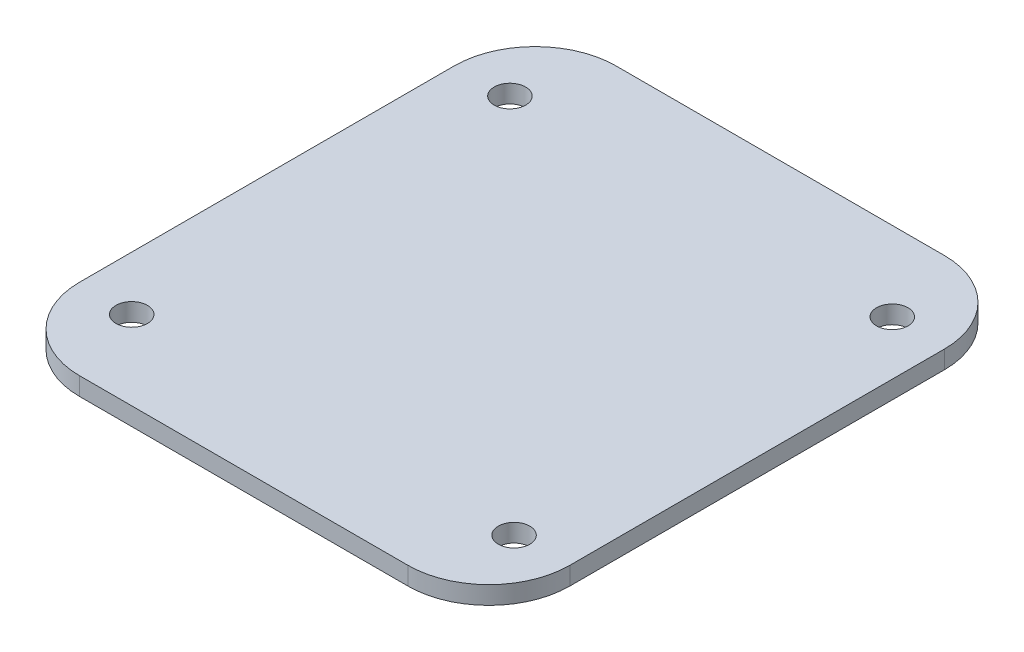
from build123d import *

# Parameters (mm, degrees)
SKETCH4_W           = 806.016009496
SKETCH4_H           = 989.965782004
MAIN_PLATE_DEPTH    = 25.4
FILLET1_R           = 139.7
SKETCH6_W           = 1279.473921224
SKETCH6_H           = 1537.086120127
EDGE_CUT_DEPTH      = 25.4
SKETCH7_W           = 1001.273344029
SKETCH7_H           = 1127.498603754
CUT_EXTRUDE4_DEPTH  = 25.4
SKETCH17_R          = 26.19375
CUT_EXTRUDE12_DEPTH = 621.952724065
SKETCH18_W          = 1235.621327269
SKETCH18_H          = 1247.027062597
CUT_EXTRUDE13_DEPTH = 621.952724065
SKETCH19_R          = 31.75
SKETCH19_R_2        = 22.225
BOSS_EXTRUDE3_DEPTH = 25.4


with BuildPart() as part:
    # Sketch4 → main plate (new body)
    with BuildSketch(Plane(origin=(0, 0, 0), x_dir=(1, 0, 0), z_dir=(0, 1, 0))):
        Rectangle(SKETCH4_W, SKETCH4_H)
    extrude(amount=MAIN_PLATE_DEPTH)

    # Fillet1
    fillet1_edges = [part.edges().sort_by_distance(p)[0] for p in [
        (-403.008004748, 12.7, -494.982891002),
        (403.008004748, 12.7, -494.982891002),
        (403.008004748, 12.7, 494.982891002),
        (-403.008004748, 12.7, 494.982891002),
    ]]
    fillet(fillet1_edges, radius=FILLET1_R)

    # Sketch6 → Edge cut (cut)
    with BuildSketch(Plane(origin=(0, 0, 0), x_dir=(1, 0, 0), z_dir=(0, 1, 0))):
        with Locations((66.592499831, 11.525402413)):
            Rectangle(SKETCH6_W, SKETCH6_H)
        with BuildLine():
            Line((403.008004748, 368.667884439), (403.008004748, -368.667884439))
            ThreePointArc((403.008004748, -368.667884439), (376.969797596, -431.529677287), (314.108004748, -457.567884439))
            Line((314.108004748, -457.567884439), (108.167567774, -457.567884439))
            ThreePointArc((108.167567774, -457.567884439), (83.867169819, -462.401534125), (63.266287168, -476.166603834))
            Line((63.266287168, -476.166603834), (63.048719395, -476.384171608))
            ThreePointArc((63.048719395, -476.384171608), (42.447836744, -490.149241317), (18.147438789, -494.982891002))
            Line((18.147438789, -494.982891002), (-18.147438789, -494.982891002))
            ThreePointArc((-18.147438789, -494.982891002), (-42.447836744, -490.149241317), (-63.048719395, -476.384171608))
            Line((-63.048719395, -476.384171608), (-63.266287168, -476.166603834))
            ThreePointArc((-63.266287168, -476.166603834), (-83.867169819, -462.401534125), (-108.167567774, -457.567884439))
            Line((-108.167567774, -457.567884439), (-314.108004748, -457.567884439))
            ThreePointArc((-314.108004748, -457.567884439), (-376.969797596, -431.529677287), (-403.008004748, -368.667884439))
            Line((-403.008004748, -368.667884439), (-403.008004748, 368.667884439))
            ThreePointArc((-403.008004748, 368.667884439), (-376.969797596, 431.529677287), (-314.108004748, 457.567884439))
            Line((-314.108004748, 457.567884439), (-108.167567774, 457.567884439))
            ThreePointArc((-108.167567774, 457.567884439), (-83.867169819, 462.401534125), (-63.266287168, 476.166603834))
            Line((-63.266287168, 476.166603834), (-63.048719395, 476.384171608))
            ThreePointArc((-63.048719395, 476.384171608), (-42.447836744, 490.149241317), (-18.147438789, 494.982891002))
            Line((-18.147438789, 494.982891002), (18.147438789, 494.982891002))
            ThreePointArc((18.147438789, 494.982891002), (42.447836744, 490.149241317), (63.048719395, 476.384171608))
            Line((63.048719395, 476.384171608), (63.266287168, 476.166603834))
            ThreePointArc((63.266287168, 476.166603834), (83.867169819, 462.401534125), (108.167567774, 457.567884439))
            Line((108.167567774, 457.567884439), (314.108004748, 457.567884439))
            ThreePointArc((314.108004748, 457.567884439), (376.969797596, 431.529677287), (403.008004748, 368.667884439))
        make_face(mode=Mode.SUBTRACT)
    extrude(amount=EDGE_CUT_DEPTH, mode=Mode.SUBTRACT)

    # Sketch7 → Cut-Extrude4 (cut)
    with BuildSketch(Plane(origin=(0, 0, 0), x_dir=(1, 0, 0), z_dir=(0, 1, 0))):
        with Locations((-5.885853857, -15.108703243)):
            Rectangle(SKETCH7_W, SKETCH7_H)
        with BuildLine():
            Line((-314.108004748, -444.867884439), (-108.167567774, -444.867884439))
            ThreePointArc((-108.167567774, -444.867884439), (-79.007090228, -450.668264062), (-54.286031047, -467.186347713))
            Line((-54.286031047, -467.186347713), (-54.068463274, -467.403915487))
            ThreePointArc((-54.068463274, -467.403915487), (-37.587757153, -478.415971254), (-18.147438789, -482.282891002))
            Line((-18.147438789, -482.282891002), (18.147438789, -482.282891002))
            ThreePointArc((18.147438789, -482.282891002), (37.587757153, -478.415971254), (54.068463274, -467.403915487))
            Line((54.068463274, -467.403915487), (54.286031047, -467.186347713))
            ThreePointArc((54.286031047, -467.186347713), (79.007090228, -450.668264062), (108.167567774, -444.867884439))
            Line((108.167567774, -444.867884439), (314.108004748, -444.867884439))
            ThreePointArc((314.108004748, -444.867884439), (349.929477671, -435.923085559), (377.341085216, -411.188673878))
            ThreePointArc((377.341085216, -411.188673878), (387.023810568, -383.977827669), (390.308004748, -355.282891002))
            Line((390.308004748, -355.282891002), (390.308004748, 355.282891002))
            ThreePointArc((390.308004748, 355.282891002), (387.023810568, 383.977827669), (377.341085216, 411.188673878))
            ThreePointArc((377.341085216, 411.188673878), (349.929477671, 435.923085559), (314.108004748, 444.867884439))
            Line((314.108004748, 444.867884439), (108.167567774, 444.867884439))
            ThreePointArc((108.167567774, 444.867884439), (79.007090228, 450.668264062), (54.286031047, 467.186347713))
            Line((54.286031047, 467.186347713), (54.068463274, 467.403915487))
            ThreePointArc((54.068463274, 467.403915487), (37.587757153, 478.415971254), (18.147438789, 482.282891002))
            Line((18.147438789, 482.282891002), (-18.147438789, 482.282891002))
            ThreePointArc((-18.147438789, 482.282891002), (-37.587757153, 478.415971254), (-54.068463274, 467.403915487))
            Line((-54.068463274, 467.403915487), (-54.286031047, 467.186347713))
            ThreePointArc((-54.286031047, 467.186347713), (-79.007090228, 450.668264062), (-108.167567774, 444.867884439))
            Line((-108.167567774, 444.867884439), (-314.108004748, 444.867884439))
            ThreePointArc((-314.108004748, 444.867884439), (-349.929477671, 435.923085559), (-377.341085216, 411.188673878))
            ThreePointArc((-377.341085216, 411.188673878), (-387.023810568, 383.977827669), (-390.308004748, 355.282891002))
            Line((-390.308004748, 355.282891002), (-390.308004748, -355.282891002))
            ThreePointArc((-390.308004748, -355.282891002), (-387.023810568, -383.977827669), (-377.341085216, -411.188673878))
            ThreePointArc((-377.341085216, -411.188673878), (-349.929477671, -435.923085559), (-314.108004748, -444.867884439))
        make_face(mode=Mode.SUBTRACT)
    extrude(amount=CUT_EXTRUDE4_DEPTH, mode=Mode.SUBTRACT)

    # Sketch17 → Cut-Extrude12 (cut, through all)
    with BuildSketch(Plane(origin=(0, 0, 0), x_dir=(1, 0, 0), z_dir=(0, 1, 0))):
        with Locations(Location((-269.922207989, 267.001207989, 0), (0, 0, 270))):
            Circle(SKETCH17_R)
        with Locations(Location((269.922207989, 267.001207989, 0), (0, 0, 270))):
            Circle(SKETCH17_R)
        with Locations(Location((269.922207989, -267.001207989, 0), (0, 0, 270))):
            Circle(SKETCH17_R)
        with Locations(Location((-269.922207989, -267.001207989, 0), (0, 0, 270))):
            Circle(SKETCH17_R)
    extrude(amount=CUT_EXTRUDE12_DEPTH, mode=Mode.SUBTRACT)

    # Sketch18 → Cut-Extrude13 (cut, through all)
    with BuildSketch(Plane(origin=(0, 0, 0), x_dir=(1, 0, 0), z_dir=(0, 1, 0))):
        with Locations((6.24823558, -20.634849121)):
            Rectangle(SKETCH18_W, SKETCH18_H)
        with BuildLine():
            Line((-231.822207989, 378.761207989), (231.822207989, 378.761207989))
            ThreePointArc((231.822207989, 378.761207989), (312.644513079, 345.283513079), (346.122207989, 264.461207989))
            Line((346.122207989, 264.461207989), (346.122207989, -264.461207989))
            ThreePointArc((346.122207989, -264.461207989), (312.644513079, -345.283513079), (231.822207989, -378.761207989))
            Line((231.822207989, -378.761207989), (-231.822207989, -378.761207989))
            ThreePointArc((-231.822207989, -378.761207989), (-312.644513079, -345.283513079), (-346.122207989, -264.461207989))
            Line((-346.122207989, -264.461207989), (-346.122207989, 264.461207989))
            ThreePointArc((-346.122207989, 264.461207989), (-312.644513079, 345.283513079), (-231.822207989, 378.761207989))
        make_face(mode=Mode.SUBTRACT)
    extrude(amount=CUT_EXTRUDE13_DEPTH, mode=Mode.SUBTRACT)

    # Sketch19 → Boss-Extrude3 (add)
    # profile 1 of 4: a face of its own
    with BuildSketch(Plane(origin=(0, 0, 0), x_dir=(1, 0, 0), z_dir=(0, 1, 0))):
        with Locations((-269.922207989, -267.001207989)):
            Circle(SKETCH19_R)
        with Locations(Location((-269.922207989, -267.001207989, 0), (0, 0, 270))):
            Circle(SKETCH19_R_2, mode=Mode.SUBTRACT)
    # profile 2 of 4: a face of its own
    with BuildSketch(Plane(origin=(0, 0, 0), x_dir=(1, 0, 0), z_dir=(0, 1, 0))):
        with Locations((-269.922207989, 267.001207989)):
            Circle(SKETCH19_R)
        with Locations(Location((-269.922207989, 267.001207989, 0), (0, 0, 270))):
            Circle(SKETCH19_R_2, mode=Mode.SUBTRACT)
    # profile 3 of 4: a face of its own
    with BuildSketch(Plane(origin=(0, 0, 0), x_dir=(1, 0, 0), z_dir=(0, 1, 0))):
        with Locations((269.922207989, 267.001207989)):
            Circle(SKETCH19_R)
        with Locations(Location((269.922207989, 267.001207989, 0), (0, 0, 270))):
            Circle(SKETCH19_R_2, mode=Mode.SUBTRACT)
    # profile 4 of 4: a face of its own
    with BuildSketch(Plane(origin=(0, 0, 0), x_dir=(1, 0, 0), z_dir=(0, 1, 0))):
        with Locations((269.922207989, -267.001207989)):
            Circle(SKETCH19_R)
        with Locations(Location((269.922207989, -267.001207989, 0), (0, 0, 270))):
            Circle(SKETCH19_R_2, mode=Mode.SUBTRACT)
    extrude(amount=BOSS_EXTRUDE3_DEPTH)


solid = part.part
